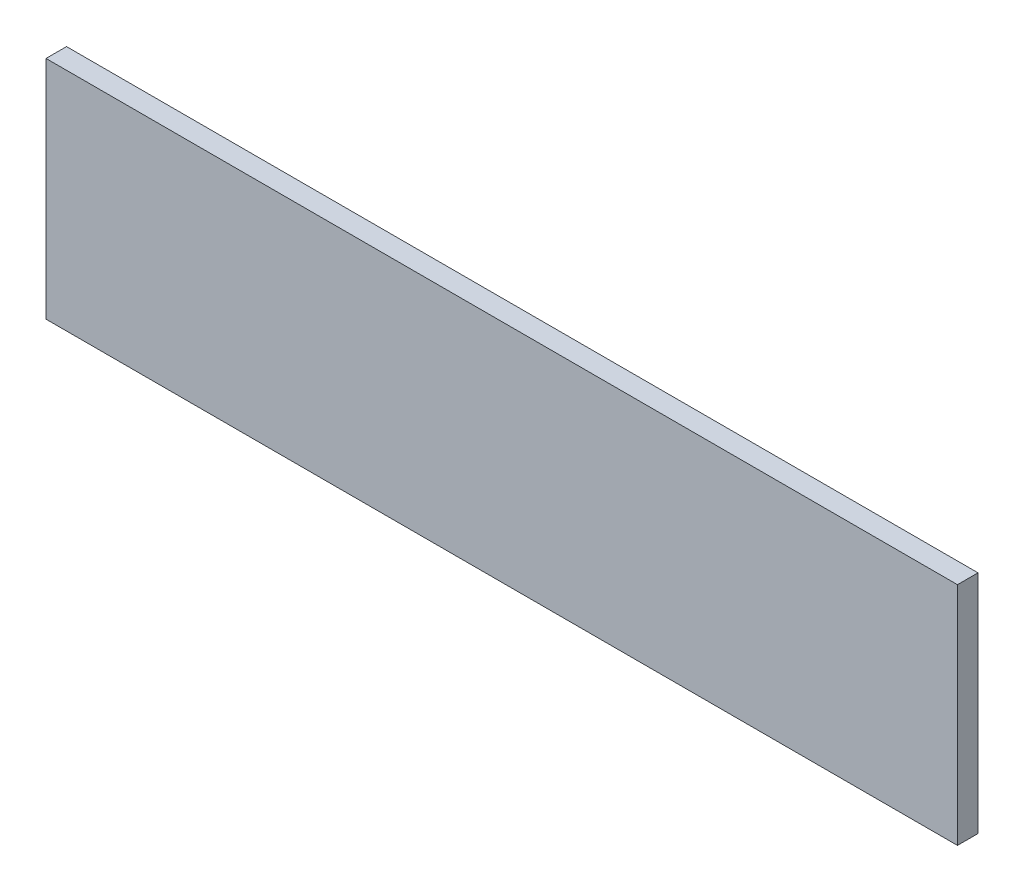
ISO-10303-21;
HEADER;
FILE_DESCRIPTION(('STEP AP214'),'2;1');
FILE_NAME('part.step','',(''),(''),'','','');
FILE_SCHEMA(('AUTOMOTIVE_DESIGN { 1 0 10303 214 1 1 1 1 }'));
ENDSEC;
DATA;
#1=APPLICATION_CONTEXT('core data for automotive mechanical design processes');
#2=APPLICATION_PROTOCOL_DEFINITION('international standard','automotive_design',2000,#1);
#3=PRODUCT_CONTEXT('',#1,'mechanical');
#4=PRODUCT('Part','Part','',(#3));
#5=PRODUCT_RELATED_PRODUCT_CATEGORY('part','',(#4));
#6=PRODUCT_DEFINITION_FORMATION('','',#4);
#7=PRODUCT_DEFINITION_CONTEXT('part definition',#1,'design');
#8=PRODUCT_DEFINITION('design','',#6,#7);
#9=PRODUCT_DEFINITION_SHAPE('','',#8);
#10=(LENGTH_UNIT() NAMED_UNIT(*) SI_UNIT(.MILLI.,.METRE.));
#11=(NAMED_UNIT(*) PLANE_ANGLE_UNIT() SI_UNIT($,.RADIAN.));
#12=(NAMED_UNIT(*) SI_UNIT($,.STERADIAN.) SOLID_ANGLE_UNIT());
#13=UNCERTAINTY_MEASURE_WITH_UNIT(LENGTH_MEASURE(1.E-05),#10,'distance_accuracy_value','');
#14=(GEOMETRIC_REPRESENTATION_CONTEXT(3) GLOBAL_UNCERTAINTY_ASSIGNED_CONTEXT((#13)) GLOBAL_UNIT_ASSIGNED_CONTEXT((#10,
#11,#12)) REPRESENTATION_CONTEXT('',''));
#15=CARTESIAN_POINT('',(0.,0.,0.));
#16=DIRECTION('',(0.,0.,1.));
#17=DIRECTION('',(1.,0.,0.));
#18=AXIS2_PLACEMENT_3D('',#15,#16,#17);
#19=CARTESIAN_POINT('',(-222.,55.,5.));
#20=DIRECTION('',(1.,0.,0.));
#21=DIRECTION('',(0.,0.,-1.));
#22=AXIS2_PLACEMENT_3D('',#19,#20,#21);
#23=PLANE('',#22);
#24=DIRECTION('',(0.,-1.,0.));
#25=VECTOR('',#24,1.);
#26=CARTESIAN_POINT('',(-222.,55.,0.));
#27=LINE('',#26,#25);
#28=CARTESIAN_POINT('',(-222.,55.,0.));
#29=VERTEX_POINT('',#28);
#30=CARTESIAN_POINT('',(-222.,0.,0.));
#31=VERTEX_POINT('',#30);
#32=EDGE_CURVE('E96',#29,#31,#27,.T.);
#33=ORIENTED_EDGE('',*,*,#32,.T.);
#34=DIRECTION('',(0.,0.,-1.));
#35=VECTOR('',#34,1.);
#36=CARTESIAN_POINT('',(-222.,0.,5.));
#37=LINE('',#36,#35);
#38=CARTESIAN_POINT('',(-222.,0.,5.));
#39=VERTEX_POINT('',#38);
#40=EDGE_CURVE('E11',#39,#31,#37,.T.);
#41=ORIENTED_EDGE('',*,*,#40,.F.);
#42=DIRECTION('',(0.,-1.,0.));
#43=VECTOR('',#42,1.);
#44=CARTESIAN_POINT('',(-222.,55.,5.));
#45=LINE('',#44,#43);
#46=CARTESIAN_POINT('',(-222.,55.,5.));
#47=VERTEX_POINT('',#46);
#48=EDGE_CURVE('E84',#47,#39,#45,.T.);
#49=ORIENTED_EDGE('',*,*,#48,.F.);
#50=DIRECTION('',(0.,0.,-1.));
#51=VECTOR('',#50,1.);
#52=CARTESIAN_POINT('',(-222.,55.,5.));
#53=LINE('',#52,#51);
#54=EDGE_CURVE('E92',#47,#29,#53,.T.);
#55=ORIENTED_EDGE('',*,*,#54,.T.);
#56=EDGE_LOOP('',(#33,#41,#49,#55));
#57=FACE_BOUND('',#56,.T.);
#58=ADVANCED_FACE('F33',(#57),#23,.F.);
#59=CARTESIAN_POINT('',(-222.,0.,5.));
#60=DIRECTION('',(0.,1.,0.));
#61=DIRECTION('',(0.,0.,1.));
#62=AXIS2_PLACEMENT_3D('',#59,#60,#61);
#63=PLANE('',#62);
#64=DIRECTION('',(1.,0.,0.));
#65=VECTOR('',#64,1.);
#66=CARTESIAN_POINT('',(-222.,0.,0.));
#67=LINE('',#66,#65);
#68=CARTESIAN_POINT('',(0.,0.,0.));
#69=VERTEX_POINT('',#68);
#70=EDGE_CURVE('E88',#31,#69,#67,.T.);
#71=ORIENTED_EDGE('',*,*,#70,.T.);
#72=DIRECTION('',(0.,0.,-1.));
#73=VECTOR('',#72,1.);
#74=CARTESIAN_POINT('',(0.,0.,5.));
#75=LINE('',#74,#73);
#76=CARTESIAN_POINT('',(0.,0.,5.));
#77=VERTEX_POINT('',#76);
#78=EDGE_CURVE('E41',#77,#69,#75,.T.);
#79=ORIENTED_EDGE('',*,*,#78,.F.);
#80=DIRECTION('',(1.,0.,0.));
#81=VECTOR('',#80,1.);
#82=CARTESIAN_POINT('',(-222.,0.,5.));
#83=LINE('',#82,#81);
#84=EDGE_CURVE('E79',#39,#77,#83,.T.);
#85=ORIENTED_EDGE('',*,*,#84,.F.);
#86=ORIENTED_EDGE('',*,*,#40,.T.);
#87=EDGE_LOOP('',(#71,#79,#85,#86));
#88=FACE_BOUND('',#87,.T.);
#89=ADVANCED_FACE('F87',(#88),#63,.F.);
#90=CARTESIAN_POINT('',(0.,55.,5.));
#91=DIRECTION('',(-1.,0.,0.));
#92=DIRECTION('',(0.,0.,1.));
#93=AXIS2_PLACEMENT_3D('',#90,#91,#92);
#94=PLANE('',#93);
#95=DIRECTION('',(0.,1.,0.));
#96=VECTOR('',#95,1.);
#97=CARTESIAN_POINT('',(0.,55.,0.));
#98=LINE('',#97,#96);
#99=CARTESIAN_POINT('',(0.,55.,0.));
#100=VERTEX_POINT('',#99);
#101=EDGE_CURVE('E66',#69,#100,#98,.T.);
#102=ORIENTED_EDGE('',*,*,#101,.T.);
#103=DIRECTION('',(0.,0.,-1.));
#104=VECTOR('',#103,1.);
#105=CARTESIAN_POINT('',(0.,55.,5.));
#106=LINE('',#105,#104);
#107=CARTESIAN_POINT('',(0.,55.,5.));
#108=VERTEX_POINT('',#107);
#109=EDGE_CURVE('E89',#108,#100,#106,.T.);
#110=ORIENTED_EDGE('',*,*,#109,.F.);
#111=DIRECTION('',(0.,1.,0.));
#112=VECTOR('',#111,1.);
#113=CARTESIAN_POINT('',(0.,55.,5.));
#114=LINE('',#113,#112);
#115=EDGE_CURVE('E82',#77,#108,#114,.T.);
#116=ORIENTED_EDGE('',*,*,#115,.F.);
#117=ORIENTED_EDGE('',*,*,#78,.T.);
#118=EDGE_LOOP('',(#102,#110,#116,#117));
#119=FACE_BOUND('',#118,.T.);
#120=ADVANCED_FACE('F90',(#119),#94,.F.);
#121=CARTESIAN_POINT('',(-222.,55.,5.));
#122=DIRECTION('',(0.,-1.,0.));
#123=DIRECTION('',(0.,0.,-1.));
#124=AXIS2_PLACEMENT_3D('',#121,#122,#123);
#125=PLANE('',#124);
#126=DIRECTION('',(-1.,0.,0.));
#127=VECTOR('',#126,1.);
#128=CARTESIAN_POINT('',(-222.,55.,0.));
#129=LINE('',#128,#127);
#130=EDGE_CURVE('E72',#100,#29,#129,.T.);
#131=ORIENTED_EDGE('',*,*,#130,.T.);
#132=ORIENTED_EDGE('',*,*,#54,.F.);
#133=DIRECTION('',(-1.,0.,0.));
#134=VECTOR('',#133,1.);
#135=CARTESIAN_POINT('',(-222.,55.,5.));
#136=LINE('',#135,#134);
#137=EDGE_CURVE('E49',#108,#47,#136,.T.);
#138=ORIENTED_EDGE('',*,*,#137,.F.);
#139=ORIENTED_EDGE('',*,*,#109,.T.);
#140=EDGE_LOOP('',(#131,#132,#138,#139));
#141=FACE_BOUND('',#140,.T.);
#142=ADVANCED_FACE('F103',(#141),#125,.F.);
#143=CARTESIAN_POINT('',(-222.,0.,5.));
#144=DIRECTION('',(0.,0.,1.));
#145=DIRECTION('',(1.,0.,0.));
#146=AXIS2_PLACEMENT_3D('',#143,#144,#145);
#147=PLANE('',#146);
#148=ORIENTED_EDGE('',*,*,#48,.T.);
#149=ORIENTED_EDGE('',*,*,#84,.T.);
#150=ORIENTED_EDGE('',*,*,#115,.T.);
#151=ORIENTED_EDGE('',*,*,#137,.T.);
#152=EDGE_LOOP('',(#148,#149,#150,#151));
#153=FACE_BOUND('',#152,.T.);
#154=ADVANCED_FACE('F80',(#153),#147,.T.);
#155=CARTESIAN_POINT('',(-222.,0.,0.));
#156=DIRECTION('',(0.,0.,1.));
#157=DIRECTION('',(1.,0.,0.));
#158=AXIS2_PLACEMENT_3D('',#155,#156,#157);
#159=PLANE('',#158);
#160=ORIENTED_EDGE('',*,*,#32,.F.);
#161=ORIENTED_EDGE('',*,*,#130,.F.);
#162=ORIENTED_EDGE('',*,*,#101,.F.);
#163=ORIENTED_EDGE('',*,*,#70,.F.);
#164=EDGE_LOOP('',(#160,#161,#162,#163));
#165=FACE_BOUND('',#164,.T.);
#166=ADVANCED_FACE('F106',(#165),#159,.F.);
#167=CLOSED_SHELL('',(#58,#89,#120,#142,#154,#166));
#168=MANIFOLD_SOLID_BREP('B2',#167);
#169=ADVANCED_BREP_SHAPE_REPRESENTATION('',(#18,#168),#14);
#170=SHAPE_DEFINITION_REPRESENTATION(#9,#169);
ENDSEC;
END-ISO-10303-21;
